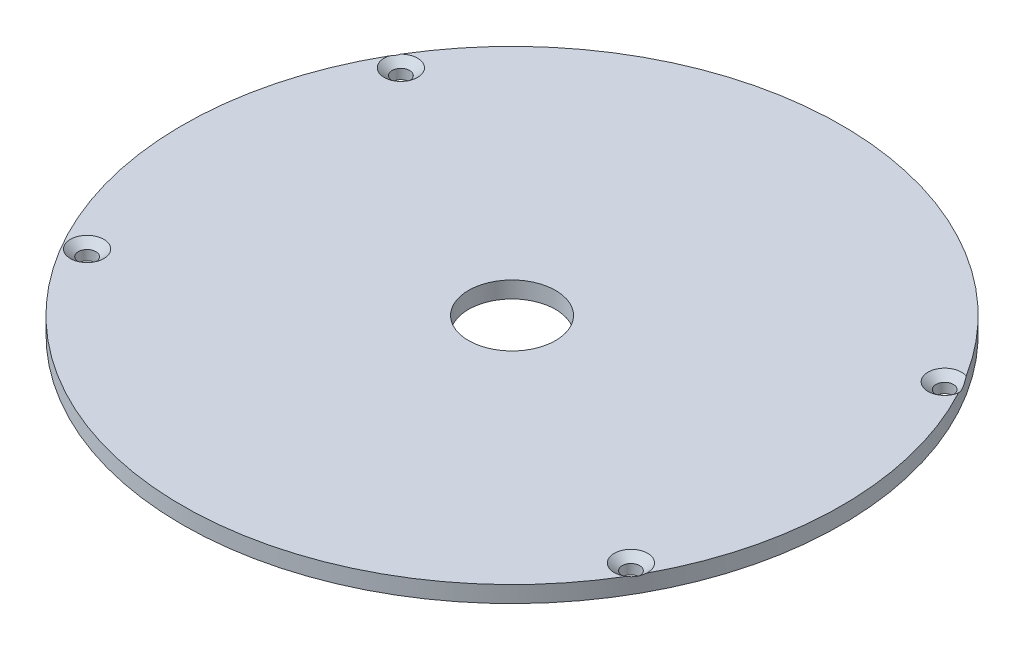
from build123d import *

# Parameters (mm, degrees)
SKETCH1_R                                           = 127
EXTRUDE1_DEPTH                                      = 6.35
SKETCH2_R                                           = 16.764
CUT_EXTRUDE1_DEPTH                                  = 6.35
CSK_FOR_1_4_FLAT_HEAD_MACHINE_SCREW_100_D           = 6.7564
CSK_FOR_1_4_FLAT_HEAD_MACHINE_SCREW_100_CSINK_D     = 12.8778
CSK_FOR_1_4_FLAT_HEAD_MACHINE_SCREW_100_CSINK_ANGLE = 100


with BuildPart() as part:
    # Sketch1 → Extrude1 (new body)
    with BuildSketch(Plane(origin=(0, 0, 0), x_dir=(1, 0, 0), z_dir=(0, 1, 0))):
        with Locations(Location((0, 0, 0), (0, 0, 270))):
            Circle(SKETCH1_R)
    extrude(amount=EXTRUDE1_DEPTH)

    # Sketch2 → Cut-Extrude1 (cut)
    with BuildSketch(Plane(origin=(0, 6.35, 0), x_dir=(-1, 0, 0), z_dir=(0, 1, 0))):
        with Locations(Location((0, 0, 0), (0, 0, 90))):
            Circle(SKETCH2_R)
    extrude(amount=-CUT_EXTRUDE1_DEPTH, mode=Mode.SUBTRACT)

    # CSK for 1_4 Flat Head Machine Screw _100 (through all)
    with Locations(Plane(origin=(105.490495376, 6.35, -61.229684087), x_dir=(0, 0, 1), z_dir=(0, 1, 0))):
        with Locations((0, 0), (120.904, 0), (120.904, -209.55), (0, -209.55)):
            CounterSinkHole(CSK_FOR_1_4_FLAT_HEAD_MACHINE_SCREW_100_D / 2, CSK_FOR_1_4_FLAT_HEAD_MACHINE_SCREW_100_CSINK_D / 2, counter_sink_angle=CSK_FOR_1_4_FLAT_HEAD_MACHINE_SCREW_100_CSINK_ANGLE)


solid = part.part
